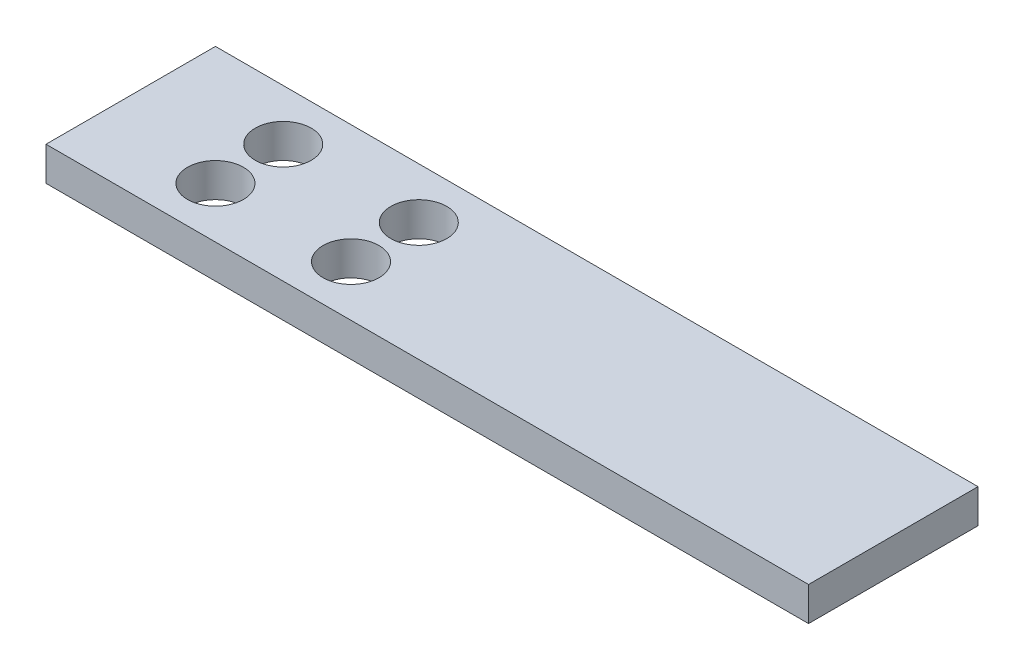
from build123d import *

# Parameters (mm, degrees)
SKETCH_1_W              = 45
SKETCH_1_H              = 10
EXTRUDE_1_DEPTH         = 2
HOLE_WIZARD_3_3_3_3_1_D = 3.3


with BuildPart() as part:
    # Sketch 1 → Extrude 1 (new body)
    with BuildSketch(Plane(origin=(0, 0, 0), x_dir=(1, 0, 0), z_dir=(0, 1, 0))):
        with Locations((22.5, 5)):
            Rectangle(SKETCH_1_W, SKETCH_1_H)
    extrude(amount=EXTRUDE_1_DEPTH)

    # Hole Wizard 3.3 _3.3_ _1 (through all)
    with Locations(Plane(origin=(0, 2, 0), x_dir=(1, 0, 0), z_dir=(0, 1, 0))):
        with Locations((7, 3), (7, 7), (15, 3), (15, 7)):
            Hole(HOLE_WIZARD_3_3_3_3_1_D / 2)


solid = part.part
